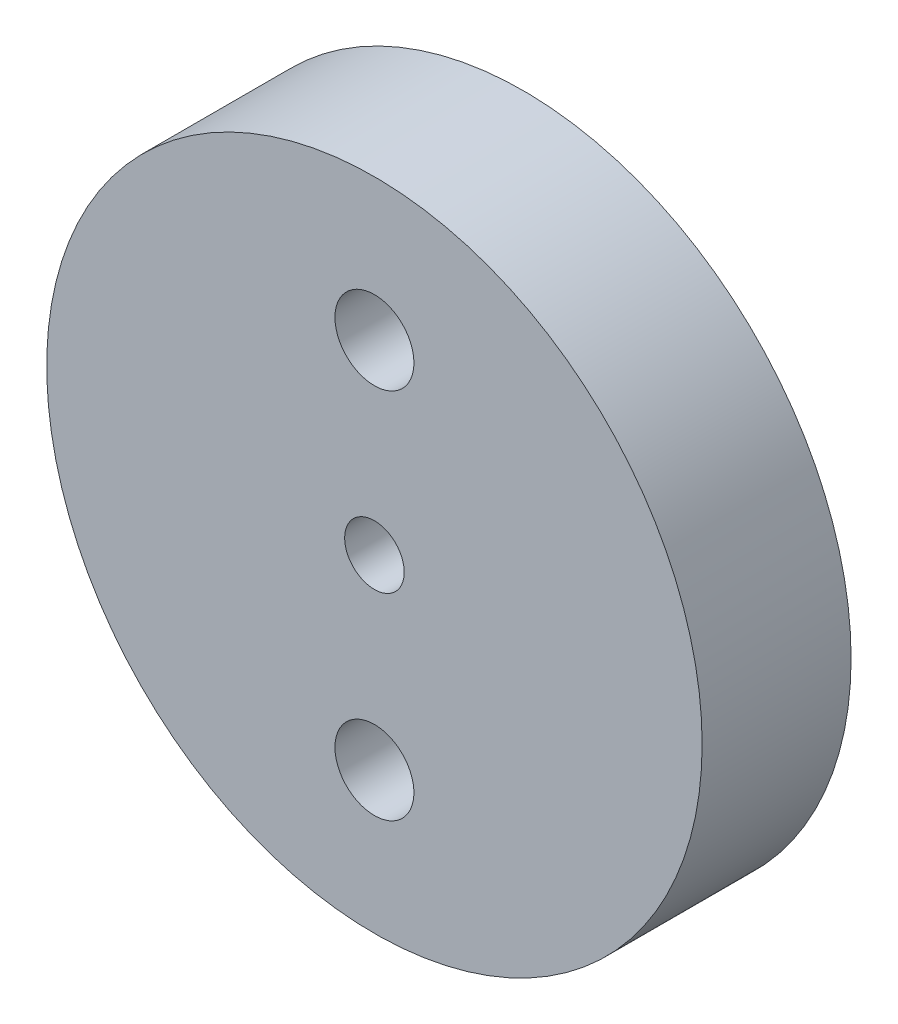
ISO-10303-21;
HEADER;
FILE_DESCRIPTION(('STEP AP214'),'2;1');
FILE_NAME('part.step','',(''),(''),'','','');
FILE_SCHEMA(('AUTOMOTIVE_DESIGN { 1 0 10303 214 1 1 1 1 }'));
ENDSEC;
DATA;
#1=APPLICATION_CONTEXT('core data for automotive mechanical design processes');
#2=APPLICATION_PROTOCOL_DEFINITION('international standard','automotive_design',2000,#1);
#3=PRODUCT_CONTEXT('',#1,'mechanical');
#4=PRODUCT('Part','Part','',(#3));
#5=PRODUCT_RELATED_PRODUCT_CATEGORY('part','',(#4));
#6=PRODUCT_DEFINITION_FORMATION('','',#4);
#7=PRODUCT_DEFINITION_CONTEXT('part definition',#1,'design');
#8=PRODUCT_DEFINITION('design','',#6,#7);
#9=PRODUCT_DEFINITION_SHAPE('','',#8);
#10=(LENGTH_UNIT() NAMED_UNIT(*) SI_UNIT(.MILLI.,.METRE.));
#11=(NAMED_UNIT(*) PLANE_ANGLE_UNIT() SI_UNIT($,.RADIAN.));
#12=(NAMED_UNIT(*) SI_UNIT($,.STERADIAN.) SOLID_ANGLE_UNIT());
#13=UNCERTAINTY_MEASURE_WITH_UNIT(LENGTH_MEASURE(1.E-05),#10,'distance_accuracy_value','');
#14=(GEOMETRIC_REPRESENTATION_CONTEXT(3) GLOBAL_UNCERTAINTY_ASSIGNED_CONTEXT((#13)) GLOBAL_UNIT_ASSIGNED_CONTEXT((#10,
#11,#12)) REPRESENTATION_CONTEXT('',''));
#15=CARTESIAN_POINT('',(0.,0.,0.));
#16=DIRECTION('',(0.,0.,1.));
#17=DIRECTION('',(1.,0.,0.));
#18=AXIS2_PLACEMENT_3D('',#15,#16,#17);
#19=CARTESIAN_POINT('',(0.,0.,0.));
#20=DIRECTION('',(0.,0.,1.));
#21=DIRECTION('',(1.,0.,0.));
#22=AXIS2_PLACEMENT_3D('',#19,#20,#21);
#23=PLANE('',#22);
#24=CARTESIAN_POINT('',(-17.5541191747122,7.27000000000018,0.));
#25=DIRECTION('',(0.,0.,-1.));
#26=DIRECTION('',(-1.,0.,0.));
#27=AXIS2_PLACEMENT_3D('',#24,#25,#26);
#28=CIRCLE('',#27,1.24999999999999);
#29=CARTESIAN_POINT('',(-18.8041191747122,7.27000000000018,0.));
#30=VERTEX_POINT('',#29);
#31=EDGE_CURVE('E77',#30,#30,#28,.T.);
#32=ORIENTED_EDGE('',*,*,#31,.F.);
#33=EDGE_LOOP('',(#32));
#34=FACE_BOUND('',#33,.T.);
#35=CARTESIAN_POINT('',(-17.5533030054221,-7.27197040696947,0.));
#36=DIRECTION('',(0.,0.,-1.));
#37=DIRECTION('',(-1.,0.,0.));
#38=AXIS2_PLACEMENT_3D('',#35,#36,#37);
#39=CIRCLE('',#38,1.24999999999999);
#40=CARTESIAN_POINT('',(-18.8033030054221,-7.27197040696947,0.));
#41=VERTEX_POINT('',#40);
#42=EDGE_CURVE('E88',#41,#41,#39,.T.);
#43=ORIENTED_EDGE('',*,*,#42,.F.);
#44=EDGE_LOOP('',(#43));
#45=FACE_BOUND('',#44,.T.);
#46=CARTESIAN_POINT('',(-7.27,-17.5541191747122,0.));
#47=DIRECTION('',(0.,0.,-1.));
#48=DIRECTION('',(-1.,0.,0.));
#49=AXIS2_PLACEMENT_3D('',#46,#47,#48);
#50=CIRCLE('',#49,1.24999999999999);
#51=CARTESIAN_POINT('',(-8.51999999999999,-17.5541191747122,0.));
#52=VERTEX_POINT('',#51);
#53=EDGE_CURVE('E94',#52,#52,#50,.T.);
#54=ORIENTED_EDGE('',*,*,#53,.F.);
#55=EDGE_LOOP('',(#54));
#56=FACE_BOUND('',#55,.T.);
#57=CARTESIAN_POINT('',(7.27197040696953,-17.5533030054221,0.));
#58=DIRECTION('',(0.,0.,-1.));
#59=DIRECTION('',(-1.,0.,0.));
#60=AXIS2_PLACEMENT_3D('',#57,#58,#59);
#61=CIRCLE('',#60,1.24999999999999);
#62=CARTESIAN_POINT('',(6.02197040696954,-17.5533030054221,0.));
#63=VERTEX_POINT('',#62);
#64=EDGE_CURVE('E100',#63,#63,#61,.T.);
#65=ORIENTED_EDGE('',*,*,#64,.F.);
#66=EDGE_LOOP('',(#65));
#67=FACE_BOUND('',#66,.T.);
#68=CARTESIAN_POINT('',(17.5541191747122,-7.27000000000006,0.));
#69=DIRECTION('',(0.,0.,-1.));
#70=DIRECTION('',(-1.,0.,0.));
#71=AXIS2_PLACEMENT_3D('',#68,#69,#70);
#72=CIRCLE('',#71,1.24999999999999);
#73=CARTESIAN_POINT('',(16.3041191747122,-7.27000000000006,0.));
#74=VERTEX_POINT('',#73);
#75=EDGE_CURVE('E106',#74,#74,#72,.T.);
#76=ORIENTED_EDGE('',*,*,#75,.F.);
#77=EDGE_LOOP('',(#76));
#78=FACE_BOUND('',#77,.T.);
#79=CARTESIAN_POINT('',(17.553303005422,7.2719704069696,0.));
#80=DIRECTION('',(0.,0.,-1.));
#81=DIRECTION('',(-1.,0.,0.));
#82=AXIS2_PLACEMENT_3D('',#79,#80,#81);
#83=CIRCLE('',#82,1.24999999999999);
#84=CARTESIAN_POINT('',(16.303303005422,7.2719704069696,0.));
#85=VERTEX_POINT('',#84);
#86=EDGE_CURVE('E112',#85,#85,#83,.T.);
#87=ORIENTED_EDGE('',*,*,#86,.F.);
#88=EDGE_LOOP('',(#87));
#89=FACE_BOUND('',#88,.T.);
#90=CARTESIAN_POINT('',(7.27,17.5541191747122,0.));
#91=DIRECTION('',(0.,0.,-1.));
#92=DIRECTION('',(-1.,0.,0.));
#93=AXIS2_PLACEMENT_3D('',#90,#91,#92);
#94=CIRCLE('',#93,1.24999999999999);
#95=CARTESIAN_POINT('',(6.02000000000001,17.5541191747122,0.));
#96=VERTEX_POINT('',#95);
#97=EDGE_CURVE('E118',#96,#96,#94,.T.);
#98=ORIENTED_EDGE('',*,*,#97,.F.);
#99=EDGE_LOOP('',(#98));
#100=FACE_BOUND('',#99,.T.);
#101=CARTESIAN_POINT('',(0.,-12.495,0.));
#102=DIRECTION('',(0.,0.,-1.));
#103=DIRECTION('',(-1.,0.,0.));
#104=AXIS2_PLACEMENT_3D('',#101,#102,#103);
#105=CIRCLE('',#104,5.);
#106=CARTESIAN_POINT('',(-5.,-12.495,0.));
#107=VERTEX_POINT('',#106);
#108=EDGE_CURVE('E124',#107,#107,#105,.T.);
#109=ORIENTED_EDGE('',*,*,#108,.F.);
#110=EDGE_LOOP('',(#109));
#111=FACE_BOUND('',#110,.T.);
#112=CARTESIAN_POINT('',(0.,12.495,0.));
#113=DIRECTION('',(0.,0.,-1.));
#114=DIRECTION('',(-1.,0.,0.));
#115=AXIS2_PLACEMENT_3D('',#112,#113,#114);
#116=CIRCLE('',#115,5.);
#117=CARTESIAN_POINT('',(-5.,12.495,0.));
#118=VERTEX_POINT('',#117);
#119=EDGE_CURVE('E136',#118,#118,#116,.T.);
#120=ORIENTED_EDGE('',*,*,#119,.F.);
#121=EDGE_LOOP('',(#120));
#122=FACE_BOUND('',#121,.T.);
#123=CARTESIAN_POINT('',(0.,0.,0.));
#124=DIRECTION('',(0.,0.,-1.));
#125=DIRECTION('',(-1.,0.,0.));
#126=AXIS2_PLACEMENT_3D('',#123,#124,#125);
#127=CIRCLE('',#126,2.);
#128=CARTESIAN_POINT('',(-2.,0.,0.));
#129=VERTEX_POINT('',#128);
#130=EDGE_CURVE('E148',#129,#129,#127,.T.);
#131=ORIENTED_EDGE('',*,*,#130,.F.);
#132=EDGE_LOOP('',(#131));
#133=FACE_BOUND('',#132,.T.);
#134=CARTESIAN_POINT('',(0.,0.,0.));
#135=DIRECTION('',(0.,0.,1.));
#136=DIRECTION('',(1.,0.,0.));
#137=AXIS2_PLACEMENT_3D('',#134,#135,#136);
#138=CIRCLE('',#137,22.);
#139=CARTESIAN_POINT('',(22.,0.,0.));
#140=VERTEX_POINT('',#139);
#141=EDGE_CURVE('E38',#140,#140,#138,.T.);
#142=ORIENTED_EDGE('',*,*,#141,.F.);
#143=EDGE_LOOP('',(#142));
#144=FACE_BOUND('',#143,.T.);
#145=CARTESIAN_POINT('',(-7.27197040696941,17.5533030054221,0.));
#146=DIRECTION('',(0.,0.,-1.));
#147=DIRECTION('',(-1.,0.,0.));
#148=AXIS2_PLACEMENT_3D('',#145,#146,#147);
#149=CIRCLE('',#148,1.24999999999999);
#150=CARTESIAN_POINT('',(-8.5219704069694,17.5533030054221,0.));
#151=VERTEX_POINT('',#150);
#152=EDGE_CURVE('E78',#151,#151,#149,.T.);
#153=ORIENTED_EDGE('',*,*,#152,.F.);
#154=EDGE_LOOP('',(#153));
#155=FACE_BOUND('',#154,.T.);
#156=ADVANCED_FACE('F34',(#34,#45,#56,#67,#78,#89,#100,#111,#122,#133,#144,#155),#23,.F.);
#157=CARTESIAN_POINT('',(0.,0.,10.));
#158=DIRECTION('',(0.,0.,-1.));
#159=DIRECTION('',(-1.,0.,0.));
#160=AXIS2_PLACEMENT_3D('',#157,#158,#159);
#161=CYLINDRICAL_SURFACE('',#160,22.);
#162=CARTESIAN_POINT('',(0.,0.,10.));
#163=DIRECTION('',(0.,0.,1.));
#164=DIRECTION('',(1.,0.,0.));
#165=AXIS2_PLACEMENT_3D('',#162,#163,#164);
#166=CIRCLE('',#165,22.);
#167=CARTESIAN_POINT('',(22.,0.,10.));
#168=VERTEX_POINT('',#167);
#169=EDGE_CURVE('E11',#168,#168,#166,.T.);
#170=ORIENTED_EDGE('',*,*,#169,.F.);
#171=EDGE_LOOP('',(#170));
#172=FACE_BOUND('',#171,.T.);
#173=ORIENTED_EDGE('',*,*,#141,.T.);
#174=EDGE_LOOP('',(#173));
#175=FACE_BOUND('',#174,.T.);
#176=ADVANCED_FACE('F36',(#172,#175),#161,.T.);
#177=CARTESIAN_POINT('',(0.,0.,10.));
#178=DIRECTION('',(0.,0.,1.));
#179=DIRECTION('',(1.,0.,0.));
#180=AXIS2_PLACEMENT_3D('',#177,#178,#179);
#181=PLANE('',#180);
#182=CARTESIAN_POINT('',(0.,-12.495,10.));
#183=DIRECTION('',(0.,0.,-1.));
#184=DIRECTION('',(-1.,0.,0.));
#185=AXIS2_PLACEMENT_3D('',#182,#183,#184);
#186=CIRCLE('',#185,2.65);
#187=CARTESIAN_POINT('',(-2.65,-12.495,10.));
#188=VERTEX_POINT('',#187);
#189=EDGE_CURVE('E133',#188,#188,#186,.T.);
#190=ORIENTED_EDGE('',*,*,#189,.T.);
#191=EDGE_LOOP('',(#190));
#192=FACE_BOUND('',#191,.T.);
#193=CARTESIAN_POINT('',(0.,12.495,10.));
#194=DIRECTION('',(0.,0.,-1.));
#195=DIRECTION('',(-1.,0.,0.));
#196=AXIS2_PLACEMENT_3D('',#193,#194,#195);
#197=CIRCLE('',#196,2.65);
#198=CARTESIAN_POINT('',(-2.65,12.495,10.));
#199=VERTEX_POINT('',#198);
#200=EDGE_CURVE('E145',#199,#199,#197,.T.);
#201=ORIENTED_EDGE('',*,*,#200,.T.);
#202=EDGE_LOOP('',(#201));
#203=FACE_BOUND('',#202,.T.);
#204=CARTESIAN_POINT('',(0.,0.,10.));
#205=DIRECTION('',(0.,0.,-1.));
#206=DIRECTION('',(-1.,0.,0.));
#207=AXIS2_PLACEMENT_3D('',#204,#205,#206);
#208=CIRCLE('',#207,2.);
#209=CARTESIAN_POINT('',(-2.,0.,10.));
#210=VERTEX_POINT('',#209);
#211=EDGE_CURVE('E149',#210,#210,#208,.T.);
#212=ORIENTED_EDGE('',*,*,#211,.T.);
#213=EDGE_LOOP('',(#212));
#214=FACE_BOUND('',#213,.T.);
#215=ORIENTED_EDGE('',*,*,#169,.T.);
#216=EDGE_LOOP('',(#215));
#217=FACE_BOUND('',#216,.T.);
#218=ADVANCED_FACE('F249',(#192,#203,#214,#217),#181,.T.);
#219=CARTESIAN_POINT('',(0.,0.,10.));
#220=DIRECTION('',(0.,0.,-1.));
#221=DIRECTION('',(-1.,0.,0.));
#222=AXIS2_PLACEMENT_3D('',#219,#220,#221);
#223=CYLINDRICAL_SURFACE('',#222,2.);
#224=ORIENTED_EDGE('',*,*,#211,.F.);
#225=EDGE_LOOP('',(#224));
#226=FACE_BOUND('',#225,.T.);
#227=ORIENTED_EDGE('',*,*,#130,.T.);
#228=EDGE_LOOP('',(#227));
#229=FACE_BOUND('',#228,.T.);
#230=ADVANCED_FACE('F155',(#226,#229),#223,.F.);
#231=CARTESIAN_POINT('',(0.,12.495,0.));
#232=DIRECTION('',(0.,0.,-1.));
#233=DIRECTION('',(-1.,0.,0.));
#234=AXIS2_PLACEMENT_3D('',#231,#232,#233);
#235=CYLINDRICAL_SURFACE('',#234,2.65);
#236=ORIENTED_EDGE('',*,*,#200,.F.);
#237=EDGE_LOOP('',(#236));
#238=FACE_BOUND('',#237,.T.);
#239=CARTESIAN_POINT('',(0.,12.495,6.));
#240=DIRECTION('',(0.,0.,-1.));
#241=DIRECTION('',(-1.,0.,0.));
#242=AXIS2_PLACEMENT_3D('',#239,#240,#241);
#243=CIRCLE('',#242,2.65);
#244=CARTESIAN_POINT('',(-2.65,12.495,6.));
#245=VERTEX_POINT('',#244);
#246=EDGE_CURVE('E142',#245,#245,#243,.T.);
#247=ORIENTED_EDGE('',*,*,#246,.T.);
#248=EDGE_LOOP('',(#247));
#249=FACE_BOUND('',#248,.T.);
#250=ADVANCED_FACE('F242',(#238,#249),#235,.F.);
#251=CARTESIAN_POINT('',(2.65,12.495,6.));
#252=DIRECTION('',(0.,0.,1.));
#253=DIRECTION('',(1.,0.,0.));
#254=AXIS2_PLACEMENT_3D('',#251,#252,#253);
#255=PLANE('',#254);
#256=ORIENTED_EDGE('',*,*,#246,.F.);
#257=EDGE_LOOP('',(#256));
#258=FACE_BOUND('',#257,.T.);
#259=CARTESIAN_POINT('',(0.,12.495,6.));
#260=DIRECTION('',(0.,0.,-1.));
#261=DIRECTION('',(-1.,0.,0.));
#262=AXIS2_PLACEMENT_3D('',#259,#260,#261);
#263=CIRCLE('',#262,5.);
#264=CARTESIAN_POINT('',(-5.,12.495,6.));
#265=VERTEX_POINT('',#264);
#266=EDGE_CURVE('E139',#265,#265,#263,.T.);
#267=ORIENTED_EDGE('',*,*,#266,.T.);
#268=EDGE_LOOP('',(#267));
#269=FACE_BOUND('',#268,.T.);
#270=ADVANCED_FACE('F238',(#258,#269),#255,.F.);
#271=CARTESIAN_POINT('',(0.,12.495,0.));
#272=DIRECTION('',(0.,0.,-1.));
#273=DIRECTION('',(-1.,0.,0.));
#274=AXIS2_PLACEMENT_3D('',#271,#272,#273);
#275=CYLINDRICAL_SURFACE('',#274,5.);
#276=ORIENTED_EDGE('',*,*,#266,.F.);
#277=EDGE_LOOP('',(#276));
#278=FACE_BOUND('',#277,.T.);
#279=ORIENTED_EDGE('',*,*,#119,.T.);
#280=EDGE_LOOP('',(#279));
#281=FACE_BOUND('',#280,.T.);
#282=ADVANCED_FACE('F234',(#278,#281),#275,.F.);
#283=CARTESIAN_POINT('',(0.,-12.495,0.));
#284=DIRECTION('',(0.,0.,-1.));
#285=DIRECTION('',(-1.,0.,0.));
#286=AXIS2_PLACEMENT_3D('',#283,#284,#285);
#287=CYLINDRICAL_SURFACE('',#286,2.65);
#288=ORIENTED_EDGE('',*,*,#189,.F.);
#289=EDGE_LOOP('',(#288));
#290=FACE_BOUND('',#289,.T.);
#291=CARTESIAN_POINT('',(0.,-12.495,6.));
#292=DIRECTION('',(0.,0.,-1.));
#293=DIRECTION('',(-1.,0.,0.));
#294=AXIS2_PLACEMENT_3D('',#291,#292,#293);
#295=CIRCLE('',#294,2.65);
#296=CARTESIAN_POINT('',(-2.65,-12.495,6.));
#297=VERTEX_POINT('',#296);
#298=EDGE_CURVE('E130',#297,#297,#295,.T.);
#299=ORIENTED_EDGE('',*,*,#298,.T.);
#300=EDGE_LOOP('',(#299));
#301=FACE_BOUND('',#300,.T.);
#302=ADVANCED_FACE('F230',(#290,#301),#287,.F.);
#303=CARTESIAN_POINT('',(2.65,-12.495,6.));
#304=DIRECTION('',(0.,0.,1.));
#305=DIRECTION('',(1.,0.,0.));
#306=AXIS2_PLACEMENT_3D('',#303,#304,#305);
#307=PLANE('',#306);
#308=ORIENTED_EDGE('',*,*,#298,.F.);
#309=EDGE_LOOP('',(#308));
#310=FACE_BOUND('',#309,.T.);
#311=CARTESIAN_POINT('',(0.,-12.495,6.));
#312=DIRECTION('',(0.,0.,-1.));
#313=DIRECTION('',(-1.,0.,0.));
#314=AXIS2_PLACEMENT_3D('',#311,#312,#313);
#315=CIRCLE('',#314,5.);
#316=CARTESIAN_POINT('',(-5.,-12.495,6.));
#317=VERTEX_POINT('',#316);
#318=EDGE_CURVE('E127',#317,#317,#315,.T.);
#319=ORIENTED_EDGE('',*,*,#318,.T.);
#320=EDGE_LOOP('',(#319));
#321=FACE_BOUND('',#320,.T.);
#322=ADVANCED_FACE('F226',(#310,#321),#307,.F.);
#323=CARTESIAN_POINT('',(0.,-12.495,0.));
#324=DIRECTION('',(0.,0.,-1.));
#325=DIRECTION('',(-1.,0.,0.));
#326=AXIS2_PLACEMENT_3D('',#323,#324,#325);
#327=CYLINDRICAL_SURFACE('',#326,5.);
#328=ORIENTED_EDGE('',*,*,#318,.F.);
#329=EDGE_LOOP('',(#328));
#330=FACE_BOUND('',#329,.T.);
#331=ORIENTED_EDGE('',*,*,#108,.T.);
#332=EDGE_LOOP('',(#331));
#333=FACE_BOUND('',#332,.T.);
#334=ADVANCED_FACE('F223',(#330,#333),#327,.F.);
#335=CARTESIAN_POINT('',(7.27,17.5541191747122,8.50000000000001));
#336=DIRECTION('',(0.,0.,-1.));
#337=DIRECTION('',(-1.,0.,0.));
#338=AXIS2_PLACEMENT_3D('',#335,#336,#337);
#339=CONICAL_SURFACE('',#338,1.24999999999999,1.02974425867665);
#340=CARTESIAN_POINT('',(7.27,17.5541191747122,9.25107577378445));
#341=VERTEX_POINT('',#340);
#342=VERTEX_LOOP('',#341);
#343=FACE_BOUND('',#342,.T.);
#344=CARTESIAN_POINT('',(7.27,17.5541191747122,8.50000000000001));
#345=DIRECTION('',(0.,0.,-1.));
#346=DIRECTION('',(-1.,0.,0.));
#347=AXIS2_PLACEMENT_3D('',#344,#345,#346);
#348=CIRCLE('',#347,1.24999999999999);
#349=CARTESIAN_POINT('',(6.02000000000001,17.5541191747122,8.50000000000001));
#350=VERTEX_POINT('',#349);
#351=EDGE_CURVE('E121',#350,#350,#348,.T.);
#352=ORIENTED_EDGE('',*,*,#351,.T.);
#353=EDGE_LOOP('',(#352));
#354=FACE_BOUND('',#353,.T.);
#355=ADVANCED_FACE('F219',(#343,#354),#339,.F.);
#356=CARTESIAN_POINT('',(7.27,17.5541191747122,0.));
#357=DIRECTION('',(0.,0.,-1.));
#358=DIRECTION('',(-1.,0.,0.));
#359=AXIS2_PLACEMENT_3D('',#356,#357,#358);
#360=CYLINDRICAL_SURFACE('',#359,1.24999999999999);
#361=ORIENTED_EDGE('',*,*,#351,.F.);
#362=EDGE_LOOP('',(#361));
#363=FACE_BOUND('',#362,.T.);
#364=ORIENTED_EDGE('',*,*,#97,.T.);
#365=EDGE_LOOP('',(#364));
#366=FACE_BOUND('',#365,.T.);
#367=ADVANCED_FACE('F216',(#363,#366),#360,.F.);
#368=CARTESIAN_POINT('',(17.553303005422,7.2719704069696,8.50000000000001));
#369=DIRECTION('',(0.,0.,-1.));
#370=DIRECTION('',(-1.,0.,0.));
#371=AXIS2_PLACEMENT_3D('',#368,#369,#370);
#372=CONICAL_SURFACE('',#371,1.24999999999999,1.02974425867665);
#373=CARTESIAN_POINT('',(17.553303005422,7.2719704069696,9.25107577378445));
#374=VERTEX_POINT('',#373);
#375=VERTEX_LOOP('',#374);
#376=FACE_BOUND('',#375,.T.);
#377=CARTESIAN_POINT('',(17.553303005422,7.2719704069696,8.50000000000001));
#378=DIRECTION('',(0.,0.,-1.));
#379=DIRECTION('',(-1.,0.,0.));
#380=AXIS2_PLACEMENT_3D('',#377,#378,#379);
#381=CIRCLE('',#380,1.24999999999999);
#382=CARTESIAN_POINT('',(16.3033030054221,7.2719704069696,8.50000000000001));
#383=VERTEX_POINT('',#382);
#384=EDGE_CURVE('E115',#383,#383,#381,.T.);
#385=ORIENTED_EDGE('',*,*,#384,.T.);
#386=EDGE_LOOP('',(#385));
#387=FACE_BOUND('',#386,.T.);
#388=ADVANCED_FACE('F212',(#376,#387),#372,.F.);
#389=CARTESIAN_POINT('',(17.553303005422,7.2719704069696,0.));
#390=DIRECTION('',(0.,0.,-1.));
#391=DIRECTION('',(-1.,0.,0.));
#392=AXIS2_PLACEMENT_3D('',#389,#390,#391);
#393=CYLINDRICAL_SURFACE('',#392,1.24999999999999);
#394=ORIENTED_EDGE('',*,*,#384,.F.);
#395=EDGE_LOOP('',(#394));
#396=FACE_BOUND('',#395,.T.);
#397=ORIENTED_EDGE('',*,*,#86,.T.);
#398=EDGE_LOOP('',(#397));
#399=FACE_BOUND('',#398,.T.);
#400=ADVANCED_FACE('F208',(#396,#399),#393,.F.);
#401=CARTESIAN_POINT('',(17.5541191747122,-7.27000000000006,8.50000000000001));
#402=DIRECTION('',(0.,0.,-1.));
#403=DIRECTION('',(-1.,0.,0.));
#404=AXIS2_PLACEMENT_3D('',#401,#402,#403);
#405=CONICAL_SURFACE('',#404,1.24999999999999,1.02974425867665);
#406=CARTESIAN_POINT('',(17.5541191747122,-7.27000000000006,9.25107577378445));
#407=VERTEX_POINT('',#406);
#408=VERTEX_LOOP('',#407);
#409=FACE_BOUND('',#408,.T.);
#410=CARTESIAN_POINT('',(17.5541191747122,-7.27000000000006,8.50000000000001));
#411=DIRECTION('',(0.,0.,-1.));
#412=DIRECTION('',(-1.,0.,0.));
#413=AXIS2_PLACEMENT_3D('',#410,#411,#412);
#414=CIRCLE('',#413,1.24999999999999);
#415=CARTESIAN_POINT('',(16.3041191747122,-7.27000000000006,8.50000000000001));
#416=VERTEX_POINT('',#415);
#417=EDGE_CURVE('E109',#416,#416,#414,.T.);
#418=ORIENTED_EDGE('',*,*,#417,.T.);
#419=EDGE_LOOP('',(#418));
#420=FACE_BOUND('',#419,.T.);
#421=ADVANCED_FACE('F204',(#409,#420),#405,.F.);
#422=CARTESIAN_POINT('',(17.5541191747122,-7.27000000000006,0.));
#423=DIRECTION('',(0.,0.,-1.));
#424=DIRECTION('',(-1.,0.,0.));
#425=AXIS2_PLACEMENT_3D('',#422,#423,#424);
#426=CYLINDRICAL_SURFACE('',#425,1.24999999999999);
#427=ORIENTED_EDGE('',*,*,#417,.F.);
#428=EDGE_LOOP('',(#427));
#429=FACE_BOUND('',#428,.T.);
#430=ORIENTED_EDGE('',*,*,#75,.T.);
#431=EDGE_LOOP('',(#430));
#432=FACE_BOUND('',#431,.T.);
#433=ADVANCED_FACE('F200',(#429,#432),#426,.F.);
#434=CARTESIAN_POINT('',(7.27197040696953,-17.5533030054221,8.50000000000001));
#435=DIRECTION('',(0.,0.,-1.));
#436=DIRECTION('',(-1.,0.,0.));
#437=AXIS2_PLACEMENT_3D('',#434,#435,#436);
#438=CONICAL_SURFACE('',#437,1.24999999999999,1.02974425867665);
#439=CARTESIAN_POINT('',(7.27197040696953,-17.5533030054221,9.25107577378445));
#440=VERTEX_POINT('',#439);
#441=VERTEX_LOOP('',#440);
#442=FACE_BOUND('',#441,.T.);
#443=CARTESIAN_POINT('',(7.27197040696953,-17.5533030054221,8.50000000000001));
#444=DIRECTION('',(0.,0.,-1.));
#445=DIRECTION('',(-1.,0.,0.));
#446=AXIS2_PLACEMENT_3D('',#443,#444,#445);
#447=CIRCLE('',#446,1.24999999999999);
#448=CARTESIAN_POINT('',(6.02197040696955,-17.5533030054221,8.50000000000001));
#449=VERTEX_POINT('',#448);
#450=EDGE_CURVE('E103',#449,#449,#447,.T.);
#451=ORIENTED_EDGE('',*,*,#450,.T.);
#452=EDGE_LOOP('',(#451));
#453=FACE_BOUND('',#452,.T.);
#454=ADVANCED_FACE('F196',(#442,#453),#438,.F.);
#455=CARTESIAN_POINT('',(7.27197040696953,-17.5533030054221,0.));
#456=DIRECTION('',(0.,0.,-1.));
#457=DIRECTION('',(-1.,0.,0.));
#458=AXIS2_PLACEMENT_3D('',#455,#456,#457);
#459=CYLINDRICAL_SURFACE('',#458,1.24999999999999);
#460=ORIENTED_EDGE('',*,*,#450,.F.);
#461=EDGE_LOOP('',(#460));
#462=FACE_BOUND('',#461,.T.);
#463=ORIENTED_EDGE('',*,*,#64,.T.);
#464=EDGE_LOOP('',(#463));
#465=FACE_BOUND('',#464,.T.);
#466=ADVANCED_FACE('F192',(#462,#465),#459,.F.);
#467=CARTESIAN_POINT('',(-7.27,-17.5541191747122,8.50000000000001));
#468=DIRECTION('',(0.,0.,-1.));
#469=DIRECTION('',(-1.,0.,0.));
#470=AXIS2_PLACEMENT_3D('',#467,#468,#469);
#471=CONICAL_SURFACE('',#470,1.24999999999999,1.02974425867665);
#472=CARTESIAN_POINT('',(-7.27,-17.5541191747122,9.25107577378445));
#473=VERTEX_POINT('',#472);
#474=VERTEX_LOOP('',#473);
#475=FACE_BOUND('',#474,.T.);
#476=CARTESIAN_POINT('',(-7.27,-17.5541191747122,8.50000000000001));
#477=DIRECTION('',(0.,0.,-1.));
#478=DIRECTION('',(-1.,0.,0.));
#479=AXIS2_PLACEMENT_3D('',#476,#477,#478);
#480=CIRCLE('',#479,1.24999999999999);
#481=CARTESIAN_POINT('',(-8.51999999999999,-17.5541191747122,8.50000000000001));
#482=VERTEX_POINT('',#481);
#483=EDGE_CURVE('E97',#482,#482,#480,.T.);
#484=ORIENTED_EDGE('',*,*,#483,.T.);
#485=EDGE_LOOP('',(#484));
#486=FACE_BOUND('',#485,.T.);
#487=ADVANCED_FACE('F188',(#475,#486),#471,.F.);
#488=CARTESIAN_POINT('',(-7.27,-17.5541191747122,0.));
#489=DIRECTION('',(0.,0.,-1.));
#490=DIRECTION('',(-1.,0.,0.));
#491=AXIS2_PLACEMENT_3D('',#488,#489,#490);
#492=CYLINDRICAL_SURFACE('',#491,1.24999999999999);
#493=ORIENTED_EDGE('',*,*,#483,.F.);
#494=EDGE_LOOP('',(#493));
#495=FACE_BOUND('',#494,.T.);
#496=ORIENTED_EDGE('',*,*,#53,.T.);
#497=EDGE_LOOP('',(#496));
#498=FACE_BOUND('',#497,.T.);
#499=ADVANCED_FACE('F184',(#495,#498),#492,.F.);
#500=CARTESIAN_POINT('',(-17.5533030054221,-7.27197040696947,8.50000000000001));
#501=DIRECTION('',(0.,0.,-1.));
#502=DIRECTION('',(-1.,0.,0.));
#503=AXIS2_PLACEMENT_3D('',#500,#501,#502);
#504=CONICAL_SURFACE('',#503,1.24999999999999,1.02974425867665);
#505=CARTESIAN_POINT('',(-17.5533030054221,-7.27197040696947,9.25107577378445));
#506=VERTEX_POINT('',#505);
#507=VERTEX_LOOP('',#506);
#508=FACE_BOUND('',#507,.T.);
#509=CARTESIAN_POINT('',(-17.5533030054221,-7.27197040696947,8.50000000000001));
#510=DIRECTION('',(0.,0.,-1.));
#511=DIRECTION('',(-1.,0.,0.));
#512=AXIS2_PLACEMENT_3D('',#509,#510,#511);
#513=CIRCLE('',#512,1.24999999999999);
#514=CARTESIAN_POINT('',(-18.8033030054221,-7.27197040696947,8.50000000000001));
#515=VERTEX_POINT('',#514);
#516=EDGE_CURVE('E91',#515,#515,#513,.T.);
#517=ORIENTED_EDGE('',*,*,#516,.T.);
#518=EDGE_LOOP('',(#517));
#519=FACE_BOUND('',#518,.T.);
#520=ADVANCED_FACE('F180',(#508,#519),#504,.F.);
#521=CARTESIAN_POINT('',(-17.5533030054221,-7.27197040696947,0.));
#522=DIRECTION('',(0.,0.,-1.));
#523=DIRECTION('',(-1.,0.,0.));
#524=AXIS2_PLACEMENT_3D('',#521,#522,#523);
#525=CYLINDRICAL_SURFACE('',#524,1.24999999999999);
#526=ORIENTED_EDGE('',*,*,#516,.F.);
#527=EDGE_LOOP('',(#526));
#528=FACE_BOUND('',#527,.T.);
#529=ORIENTED_EDGE('',*,*,#42,.T.);
#530=EDGE_LOOP('',(#529));
#531=FACE_BOUND('',#530,.T.);
#532=ADVANCED_FACE('F176',(#528,#531),#525,.F.);
#533=CARTESIAN_POINT('',(-17.5541191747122,7.27000000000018,8.50000000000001));
#534=DIRECTION('',(0.,0.,-1.));
#535=DIRECTION('',(-1.,0.,0.));
#536=AXIS2_PLACEMENT_3D('',#533,#534,#535);
#537=CONICAL_SURFACE('',#536,1.24999999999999,1.02974425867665);
#538=CARTESIAN_POINT('',(-17.5541191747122,7.27000000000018,9.25107577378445));
#539=VERTEX_POINT('',#538);
#540=VERTEX_LOOP('',#539);
#541=FACE_BOUND('',#540,.T.);
#542=CARTESIAN_POINT('',(-17.5541191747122,7.27000000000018,8.50000000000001));
#543=DIRECTION('',(0.,0.,-1.));
#544=DIRECTION('',(-1.,0.,0.));
#545=AXIS2_PLACEMENT_3D('',#542,#543,#544);
#546=CIRCLE('',#545,1.24999999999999);
#547=CARTESIAN_POINT('',(-18.8041191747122,7.27000000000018,8.50000000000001));
#548=VERTEX_POINT('',#547);
#549=EDGE_CURVE('E81',#548,#548,#546,.T.);
#550=ORIENTED_EDGE('',*,*,#549,.T.);
#551=EDGE_LOOP('',(#550));
#552=FACE_BOUND('',#551,.T.);
#553=ADVANCED_FACE('F172',(#541,#552),#537,.F.);
#554=CARTESIAN_POINT('',(-17.5541191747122,7.27000000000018,0.));
#555=DIRECTION('',(0.,0.,-1.));
#556=DIRECTION('',(-1.,0.,0.));
#557=AXIS2_PLACEMENT_3D('',#554,#555,#556);
#558=CYLINDRICAL_SURFACE('',#557,1.24999999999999);
#559=ORIENTED_EDGE('',*,*,#549,.F.);
#560=EDGE_LOOP('',(#559));
#561=FACE_BOUND('',#560,.T.);
#562=ORIENTED_EDGE('',*,*,#31,.T.);
#563=EDGE_LOOP('',(#562));
#564=FACE_BOUND('',#563,.T.);
#565=ADVANCED_FACE('F71',(#561,#564),#558,.F.);
#566=CARTESIAN_POINT('',(-7.27197040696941,17.5533030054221,8.50000000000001));
#567=DIRECTION('',(0.,0.,-1.));
#568=DIRECTION('',(-1.,0.,0.));
#569=AXIS2_PLACEMENT_3D('',#566,#567,#568);
#570=CONICAL_SURFACE('',#569,1.24999999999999,1.02974425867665);
#571=CARTESIAN_POINT('',(-7.27197040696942,17.5533030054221,9.25107577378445));
#572=VERTEX_POINT('',#571);
#573=VERTEX_LOOP('',#572);
#574=FACE_BOUND('',#573,.T.);
#575=CARTESIAN_POINT('',(-7.27197040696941,17.5533030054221,8.50000000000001));
#576=DIRECTION('',(0.,0.,-1.));
#577=DIRECTION('',(-1.,0.,0.));
#578=AXIS2_PLACEMENT_3D('',#575,#576,#577);
#579=CIRCLE('',#578,1.24999999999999);
#580=CARTESIAN_POINT('',(-8.5219704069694,17.5533030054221,8.50000000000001));
#581=VERTEX_POINT('',#580);
#582=EDGE_CURVE('E75',#581,#581,#579,.T.);
#583=ORIENTED_EDGE('',*,*,#582,.T.);
#584=EDGE_LOOP('',(#583));
#585=FACE_BOUND('',#584,.T.);
#586=ADVANCED_FACE('F67',(#574,#585),#570,.F.);
#587=CARTESIAN_POINT('',(-7.27197040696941,17.5533030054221,0.));
#588=DIRECTION('',(0.,0.,-1.));
#589=DIRECTION('',(-1.,0.,0.));
#590=AXIS2_PLACEMENT_3D('',#587,#588,#589);
#591=CYLINDRICAL_SURFACE('',#590,1.24999999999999);
#592=ORIENTED_EDGE('',*,*,#582,.F.);
#593=EDGE_LOOP('',(#592));
#594=FACE_BOUND('',#593,.T.);
#595=ORIENTED_EDGE('',*,*,#152,.T.);
#596=EDGE_LOOP('',(#595));
#597=FACE_BOUND('',#596,.T.);
#598=ADVANCED_FACE('F70',(#594,#597),#591,.F.);
#599=CLOSED_SHELL('',(#156,#176,#218,#230,#250,#270,#282,#302,#322,#334,#355,#367,#388,#400,
#421,#433,#454,#466,#487,#499,#520,#532,#553,#565,#586,#598));
#600=MANIFOLD_SOLID_BREP('B2',#599);
#601=ADVANCED_BREP_SHAPE_REPRESENTATION('',(#18,#600),#14);
#602=SHAPE_DEFINITION_REPRESENTATION(#9,#601);
ENDSEC;
END-ISO-10303-21;
